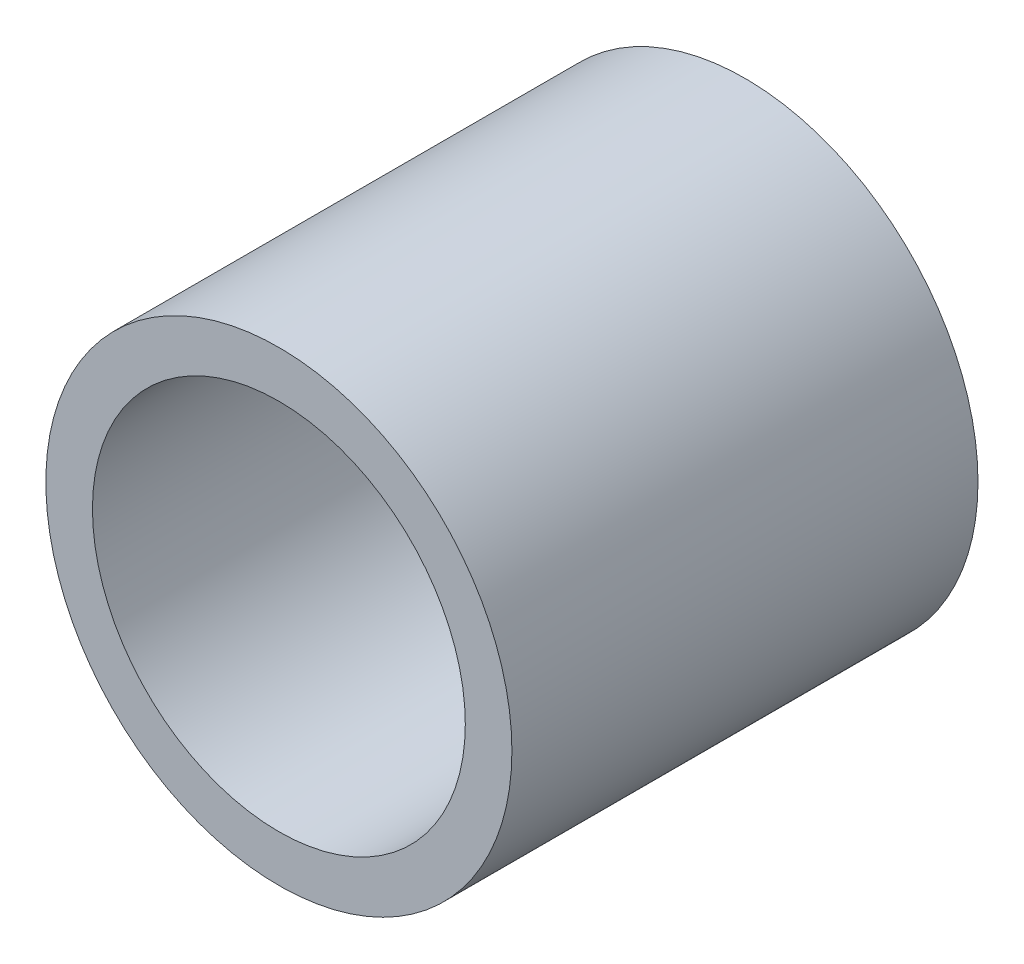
ISO-10303-21;
HEADER;
FILE_DESCRIPTION(('STEP AP214'),'2;1');
FILE_NAME('part.step','',(''),(''),'','','');
FILE_SCHEMA(('AUTOMOTIVE_DESIGN { 1 0 10303 214 1 1 1 1 }'));
ENDSEC;
DATA;
#1=APPLICATION_CONTEXT('core data for automotive mechanical design processes');
#2=APPLICATION_PROTOCOL_DEFINITION('international standard','automotive_design',2000,#1);
#3=PRODUCT_CONTEXT('',#1,'mechanical');
#4=PRODUCT('Part','Part','',(#3));
#5=PRODUCT_RELATED_PRODUCT_CATEGORY('part','',(#4));
#6=PRODUCT_DEFINITION_FORMATION('','',#4);
#7=PRODUCT_DEFINITION_CONTEXT('part definition',#1,'design');
#8=PRODUCT_DEFINITION('design','',#6,#7);
#9=PRODUCT_DEFINITION_SHAPE('','',#8);
#10=(LENGTH_UNIT() NAMED_UNIT(*) SI_UNIT(.MILLI.,.METRE.));
#11=(NAMED_UNIT(*) PLANE_ANGLE_UNIT() SI_UNIT($,.RADIAN.));
#12=(NAMED_UNIT(*) SI_UNIT($,.STERADIAN.) SOLID_ANGLE_UNIT());
#13=UNCERTAINTY_MEASURE_WITH_UNIT(LENGTH_MEASURE(1.E-05),#10,'distance_accuracy_value','');
#14=(GEOMETRIC_REPRESENTATION_CONTEXT(3) GLOBAL_UNCERTAINTY_ASSIGNED_CONTEXT((#13)) GLOBAL_UNIT_ASSIGNED_CONTEXT((#10,
#11,#12)) REPRESENTATION_CONTEXT('',''));
#15=CARTESIAN_POINT('',(0.,0.,0.));
#16=DIRECTION('',(0.,0.,1.));
#17=DIRECTION('',(1.,0.,0.));
#18=AXIS2_PLACEMENT_3D('',#15,#16,#17);
#19=CARTESIAN_POINT('',(0.,0.,25.4));
#20=DIRECTION('',(0.,0.,1.));
#21=DIRECTION('',(1.,0.,0.));
#22=AXIS2_PLACEMENT_3D('',#19,#20,#21);
#23=PLANE('',#22);
#24=CARTESIAN_POINT('',(0.,0.,25.4));
#25=DIRECTION('',(0.,0.,1.));
#26=DIRECTION('',(1.,0.,0.));
#27=AXIS2_PLACEMENT_3D('',#24,#25,#26);
#28=CIRCLE('',#27,12.7);
#29=CARTESIAN_POINT('',(12.7,0.,25.4));
#30=VERTEX_POINT('',#29);
#31=EDGE_CURVE('E10',#30,#30,#28,.T.);
#32=ORIENTED_EDGE('',*,*,#31,.T.);
#33=EDGE_LOOP('',(#32));
#34=FACE_BOUND('',#33,.T.);
#35=CARTESIAN_POINT('',(0.,0.,25.4));
#36=DIRECTION('',(0.,0.,1.));
#37=DIRECTION('',(1.,0.,0.));
#38=AXIS2_PLACEMENT_3D('',#35,#36,#37);
#39=CIRCLE('',#38,10.16);
#40=CARTESIAN_POINT('',(10.16,0.,25.4));
#41=VERTEX_POINT('',#40);
#42=EDGE_CURVE('E44',#41,#41,#39,.T.);
#43=ORIENTED_EDGE('',*,*,#42,.F.);
#44=EDGE_LOOP('',(#43));
#45=FACE_BOUND('',#44,.T.);
#46=ADVANCED_FACE('F30',(#34,#45),#23,.T.);
#47=CARTESIAN_POINT('',(0.,0.,0.));
#48=DIRECTION('',(0.,0.,1.));
#49=DIRECTION('',(1.,0.,0.));
#50=AXIS2_PLACEMENT_3D('',#47,#48,#49);
#51=PLANE('',#50);
#52=CARTESIAN_POINT('',(0.,0.,0.));
#53=DIRECTION('',(0.,0.,1.));
#54=DIRECTION('',(1.,0.,0.));
#55=AXIS2_PLACEMENT_3D('',#52,#53,#54);
#56=CIRCLE('',#55,12.7);
#57=CARTESIAN_POINT('',(12.7,0.,0.));
#58=VERTEX_POINT('',#57);
#59=EDGE_CURVE('E34',#58,#58,#56,.T.);
#60=ORIENTED_EDGE('',*,*,#59,.F.);
#61=EDGE_LOOP('',(#60));
#62=FACE_BOUND('',#61,.T.);
#63=CARTESIAN_POINT('',(0.,0.,0.));
#64=DIRECTION('',(0.,0.,1.));
#65=DIRECTION('',(1.,0.,0.));
#66=AXIS2_PLACEMENT_3D('',#63,#64,#65);
#67=CIRCLE('',#66,10.16);
#68=CARTESIAN_POINT('',(10.16,0.,0.));
#69=VERTEX_POINT('',#68);
#70=EDGE_CURVE('E46',#69,#69,#67,.T.);
#71=ORIENTED_EDGE('',*,*,#70,.T.);
#72=EDGE_LOOP('',(#71));
#73=FACE_BOUND('',#72,.T.);
#74=ADVANCED_FACE('F56',(#62,#73),#51,.F.);
#75=CARTESIAN_POINT('',(0.,0.,25.4));
#76=DIRECTION('',(0.,0.,-1.));
#77=DIRECTION('',(-1.,0.,0.));
#78=AXIS2_PLACEMENT_3D('',#75,#76,#77);
#79=CYLINDRICAL_SURFACE('',#78,12.7);
#80=ORIENTED_EDGE('',*,*,#31,.F.);
#81=EDGE_LOOP('',(#80));
#82=FACE_BOUND('',#81,.T.);
#83=ORIENTED_EDGE('',*,*,#59,.T.);
#84=EDGE_LOOP('',(#83));
#85=FACE_BOUND('',#84,.T.);
#86=ADVANCED_FACE('F32',(#82,#85),#79,.T.);
#87=CARTESIAN_POINT('',(0.,0.,25.4));
#88=DIRECTION('',(0.,0.,-1.));
#89=DIRECTION('',(-1.,0.,0.));
#90=AXIS2_PLACEMENT_3D('',#87,#88,#89);
#91=CYLINDRICAL_SURFACE('',#90,10.16);
#92=ORIENTED_EDGE('',*,*,#42,.T.);
#93=EDGE_LOOP('',(#92));
#94=FACE_BOUND('',#93,.T.);
#95=ORIENTED_EDGE('',*,*,#70,.F.);
#96=EDGE_LOOP('',(#95));
#97=FACE_BOUND('',#96,.T.);
#98=ADVANCED_FACE('F52',(#94,#97),#91,.F.);
#99=CLOSED_SHELL('',(#46,#74,#86,#98));
#100=MANIFOLD_SOLID_BREP('B2',#99);
#101=ADVANCED_BREP_SHAPE_REPRESENTATION('',(#18,#100),#14);
#102=SHAPE_DEFINITION_REPRESENTATION(#9,#101);
ENDSEC;
END-ISO-10303-21;
